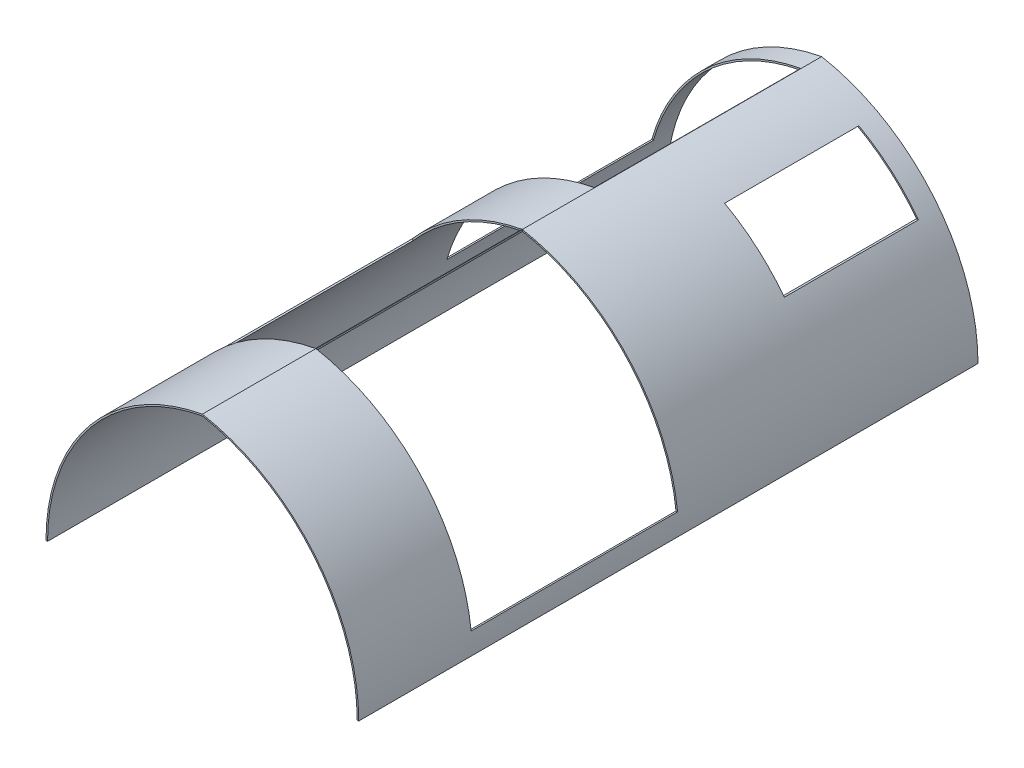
from build123d import *

# Parameters (mm, degrees)
SALIENTE_EXTRUIR1_DEPTH = 6000
CROQUIS2_W              = 1300
CROQUIS2_H              = 500
CORTAR_EXTRUIR2_DEPTH   = 1800
CROQUIS2_5_W            = 2000
CROQUIS2_5_H            = 1617.780421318
CORTAR_EXTRUIR3_DEPTH   = 1780
CROQUIS3_W              = 2000
CROQUIS3_H              = 1317.780421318
CROQUIS3_H_2            = 617.780421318
CORTAR_EXTRUIR4_DEPTH   = 1815


with BuildPart() as part:
    # Croquis1 → Saliente-Extruir1 (new body)
    with BuildSketch(Plane.XY):
        with BuildLine():
            Line((-1481.701404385, -91.370616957), (-1496.701404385, -91.370616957))
            ThreePointArc((-1496.701404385, -91.370616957), (-1068.295581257, 1091.797868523), (18.298595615, 1726.409804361))
            ThreePointArc((18.298595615, 1726.409804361), (1104.892772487, 1091.797868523), (1533.298595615, -91.370616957))
            Line((1533.298595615, -91.370616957), (1518.298595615, -91.370616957))
            ThreePointArc((1518.298595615, -91.370616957), (1094.249475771, 1081.138398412), (18.298595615, 1711.158041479))
            ThreePointArc((18.298595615, 1711.158041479), (-1057.652284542, 1081.138398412), (-1481.701404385, -91.370616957))
        make_face()
    extrude(amount=SALIENTE_EXTRUIR1_DEPTH)

    # Croquis2 → Cortar-Extruir2 (cut)
    with BuildSketch(Plane(origin=(1800, 0, 0), x_dir=(0, 0, -1), z_dir=(1, 0, 0))):
        with Locations((-850, 1276.409804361)):
            Rectangle(CROQUIS2_W, CROQUIS2_H)
    extrude(amount=-CORTAR_EXTRUIR2_DEPTH, mode=Mode.SUBTRACT)

    # Croquis2_5 → Cortar-Extruir3 (cut)
    with BuildSketch(Plane(origin=(1800, 0, 0), x_dir=(0, 0, -1), z_dir=(1, 0, 0))):
        with Locations((-3900, 917.519593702)):
            Rectangle(CROQUIS2_5_W, CROQUIS2_5_H)
    extrude(amount=-CORTAR_EXTRUIR3_DEPTH, mode=Mode.SUBTRACT)

    # Croquis3 → Cortar-Extruir4 (cut)
    with BuildSketch(Plane(origin=(-1800, 0, 0), x_dir=(0, 0, -1), z_dir=(1, 0, 0))):
        with Locations((-1200, 1067.519593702)):
            Rectangle(CROQUIS3_W, CROQUIS3_H)
        with Locations((-3900, 1417.519593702)):
            Rectangle(CROQUIS3_W, CROQUIS3_H_2)
    extrude(amount=CORTAR_EXTRUIR4_DEPTH, mode=Mode.SUBTRACT)


solid = part.part
